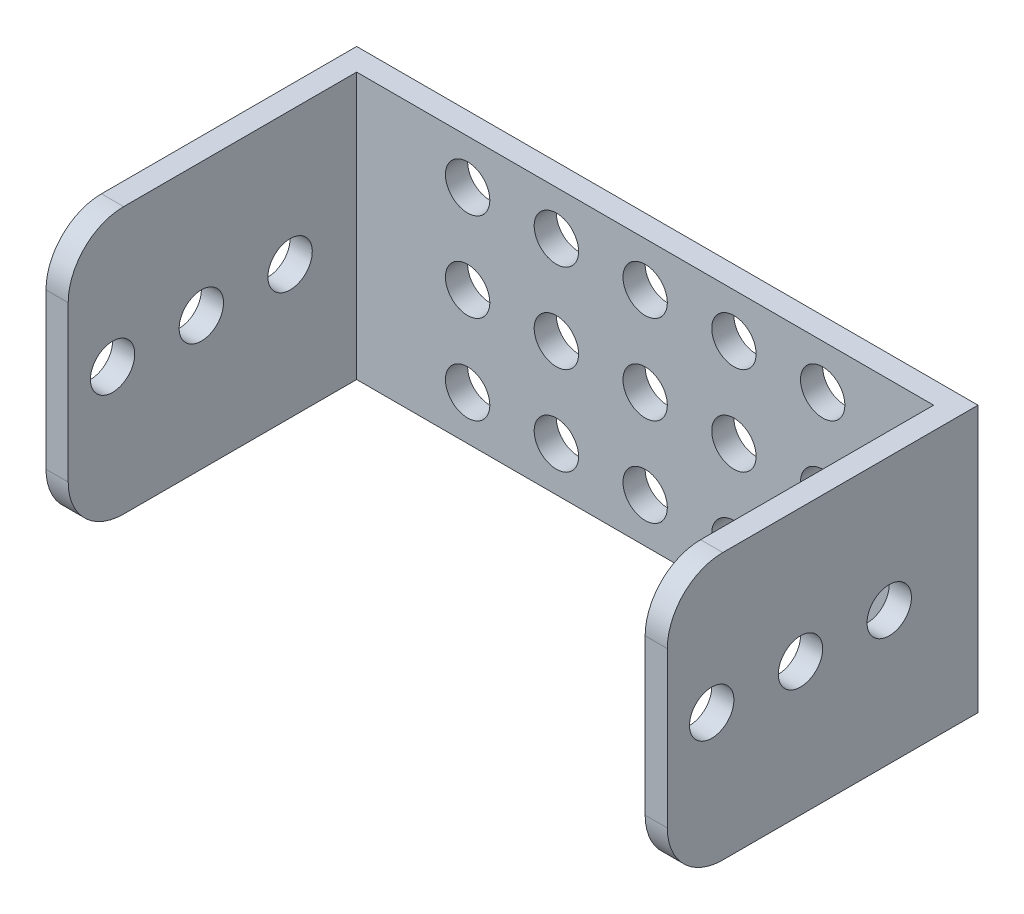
from build123d import *

# Parameters (mm, degrees)
SKETCH_1_W             = 56
SKETCH_1_H             = 24
EXTRUDE_1_DEPTH        = 2
SKETCH_2_W             = 2
SKETCH_2_H             = 24
EXTRUDE_2_DEPTH        = 26
HOLE_WIZARD_4_0_4_1_D  = 4
PATTERN_LINEAR_1_COUNT = 3
PATTERN_LINEAR_1_PITCH = 8
PATTERN_LINEAR_2_COUNT = 3
PATTERN_LINEAR_2_PITCH = 8
FILLET_1_R             = 5
HOLE_WIZARD_4_0_4_2_D  = 4


with BuildPart() as part:
    # Sketch 1 → Extrude 1 (new body)
    with BuildSketch(Plane.XY):
        Rectangle(SKETCH_1_W, SKETCH_1_H)
    extrude(amount=EXTRUDE_1_DEPTH)

    # Sketch 2 → Extrude 2 (add)
    with BuildSketch(Plane.XY.offset(2)):
        with Locations((-27, 0)):
            Rectangle(SKETCH_2_W, SKETCH_2_H)
        with Locations((27, 0)):
            Rectangle(SKETCH_2_W, SKETCH_2_H)
    extrude(amount=EXTRUDE_2_DEPTH)

    # Hole Wizard 4.0 _4_ _1 (through all)
    with Locations(Plane.XY.offset(2)):
        with Locations((0, 8), (0, 0), (0, -8)):
            hole_wizard_4_0_4_1 = Hole(HOLE_WIZARD_4_0_4_1_D / 2)

    # Pattern Linear 1: Hole Wizard 4.0 _4_ _1 ×3
    with Locations(*[(i * PATTERN_LINEAR_1_PITCH, 0, 0) for i in range(1, PATTERN_LINEAR_1_COUNT)]):
        add(hole_wizard_4_0_4_1, mode=Mode.SUBTRACT)

    # Pattern Linear 2: Hole Wizard 4.0 _4_ _1 ×3
    with Locations(*[(-i * PATTERN_LINEAR_2_PITCH, 0, 0) for i in range(1, PATTERN_LINEAR_2_COUNT)]):
        add(hole_wizard_4_0_4_1, mode=Mode.SUBTRACT)

    # Fillet 1
    fillet_1_edges = [part.edges().sort_by_distance(p)[0] for p in [
        (-27, -12, 28),
        (-27, 12, 28),
        (27, 12, 28),
        (27, -12, 28),
    ]]
    fillet(fillet_1_edges, radius=FILLET_1_R)

    # Hole Wizard 4.0 _4_ _2 (through all)
    with Locations(Plane.ZY.offset(28)):
        with Locations((24, 0), (16, 0), (8, 0)):
            Hole(HOLE_WIZARD_4_0_4_2_D / 2)


solid = part.part
